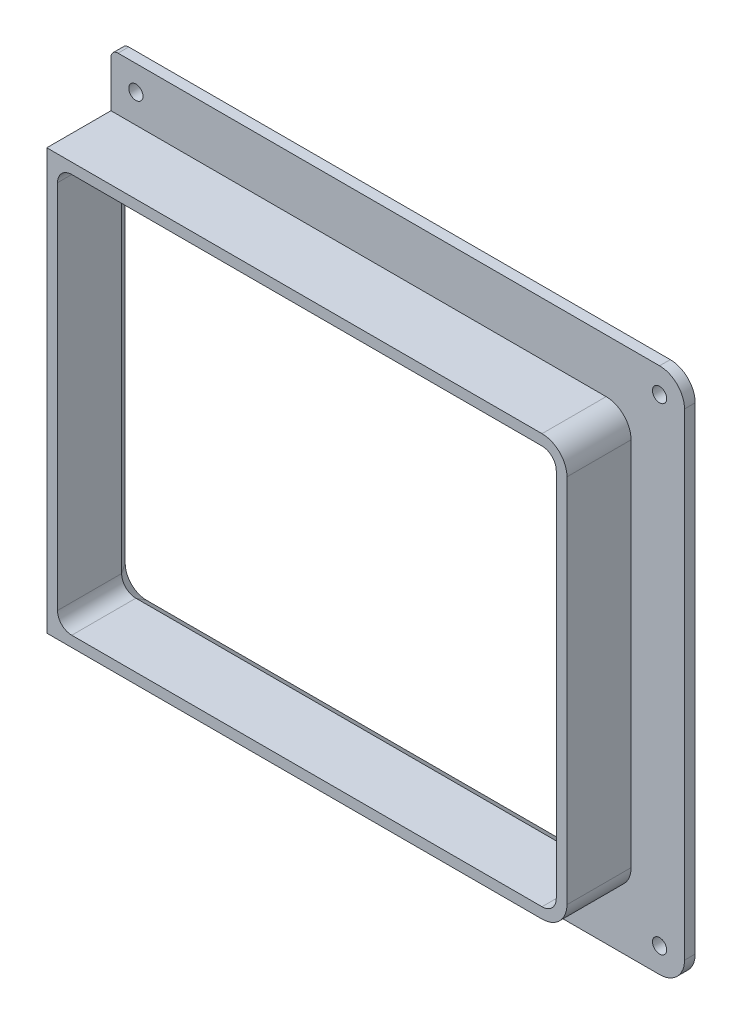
ISO-10303-21;
HEADER;
FILE_DESCRIPTION(('STEP AP214'),'2;1');
FILE_NAME('part.step','',(''),(''),'','','');
FILE_SCHEMA(('AUTOMOTIVE_DESIGN { 1 0 10303 214 1 1 1 1 }'));
ENDSEC;
DATA;
#1=APPLICATION_CONTEXT('core data for automotive mechanical design processes');
#2=APPLICATION_PROTOCOL_DEFINITION('international standard','automotive_design',2000,#1);
#3=PRODUCT_CONTEXT('',#1,'mechanical');
#4=PRODUCT('Part','Part','',(#3));
#5=PRODUCT_RELATED_PRODUCT_CATEGORY('part','',(#4));
#6=PRODUCT_DEFINITION_FORMATION('','',#4);
#7=PRODUCT_DEFINITION_CONTEXT('part definition',#1,'design');
#8=PRODUCT_DEFINITION('design','',#6,#7);
#9=PRODUCT_DEFINITION_SHAPE('','',#8);
#10=(LENGTH_UNIT() NAMED_UNIT(*) SI_UNIT(.MILLI.,.METRE.));
#11=(NAMED_UNIT(*) PLANE_ANGLE_UNIT() SI_UNIT($,.RADIAN.));
#12=(NAMED_UNIT(*) SI_UNIT($,.STERADIAN.) SOLID_ANGLE_UNIT());
#13=UNCERTAINTY_MEASURE_WITH_UNIT(LENGTH_MEASURE(1.E-05),#10,'distance_accuracy_value','');
#14=(GEOMETRIC_REPRESENTATION_CONTEXT(3) GLOBAL_UNCERTAINTY_ASSIGNED_CONTEXT((#13)) GLOBAL_UNIT_ASSIGNED_CONTEXT((#10,
#11,#12)) REPRESENTATION_CONTEXT('',''));
#15=CARTESIAN_POINT('',(0.,0.,0.));
#16=DIRECTION('',(0.,0.,1.));
#17=DIRECTION('',(1.,0.,0.));
#18=AXIS2_PLACEMENT_3D('',#15,#16,#17);
#19=CARTESIAN_POINT('',(146.,0.,0.));
#20=DIRECTION('',(1.,0.,0.));
#21=DIRECTION('',(0.,0.,-1.));
#22=AXIS2_PLACEMENT_3D('',#19,#20,#21);
#23=PLANE('',#22);
#24=DIRECTION('',(0.,-1.,0.));
#25=VECTOR('',#24,1.);
#26=CARTESIAN_POINT('',(146.,0.,21.));
#27=LINE('',#26,#25);
#28=CARTESIAN_POINT('',(146.,111.,21.));
#29=VERTEX_POINT('',#28);
#30=CARTESIAN_POINT('',(146.,7.,21.));
#31=VERTEX_POINT('',#30);
#32=EDGE_CURVE('E240',#29,#31,#27,.T.);
#33=ORIENTED_EDGE('',*,*,#32,.T.);
#34=DIRECTION('',(0.,0.,-1.));
#35=VECTOR('',#34,1.);
#36=CARTESIAN_POINT('',(146.,7.,3.));
#37=LINE('',#36,#35);
#38=CARTESIAN_POINT('',(146.,7.00000000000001,3.));
#39=VERTEX_POINT('',#38);
#40=EDGE_CURVE('E303',#31,#39,#37,.T.);
#41=ORIENTED_EDGE('',*,*,#40,.T.);
#42=DIRECTION('',(0.,-1.,0.));
#43=VECTOR('',#42,1.);
#44=CARTESIAN_POINT('',(146.,118.,3.));
#45=LINE('',#44,#43);
#46=CARTESIAN_POINT('',(146.,111.,3.));
#47=VERTEX_POINT('',#46);
#48=EDGE_CURVE('E375',#47,#39,#45,.T.);
#49=ORIENTED_EDGE('',*,*,#48,.F.);
#50=DIRECTION('',(0.,0.,-1.));
#51=VECTOR('',#50,1.);
#52=CARTESIAN_POINT('',(146.,111.,0.));
#53=LINE('',#52,#51);
#54=EDGE_CURVE('E301',#47,#29,#53,.F.);
#55=ORIENTED_EDGE('',*,*,#54,.T.);
#56=EDGE_LOOP('',(#33,#41,#49,#55));
#57=FACE_BOUND('',#56,.T.);
#58=ADVANCED_FACE('F41',(#57),#23,.T.);
#59=CARTESIAN_POINT('',(146.,118.,139.038129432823));
#60=DIRECTION('',(0.,1.,0.));
#61=DIRECTION('',(0.,0.,1.));
#62=AXIS2_PLACEMENT_3D('',#59,#60,#61);
#63=PLANE('',#62);
#64=DIRECTION('',(-1.,0.,0.));
#65=VECTOR('',#64,1.);
#66=CARTESIAN_POINT('',(146.,118.,21.));
#67=LINE('',#66,#65);
#68=CARTESIAN_POINT('',(139.,118.,21.));
#69=VERTEX_POINT('',#68);
#70=CARTESIAN_POINT('',(0.,118.,21.));
#71=VERTEX_POINT('',#70);
#72=EDGE_CURVE('E405',#69,#71,#67,.T.);
#73=ORIENTED_EDGE('',*,*,#72,.F.);
#74=DIRECTION('',(0.,0.,-1.));
#75=VECTOR('',#74,1.);
#76=CARTESIAN_POINT('',(139.,118.,139.038129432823));
#77=LINE('',#76,#75);
#78=CARTESIAN_POINT('',(139.,118.,3.));
#79=VERTEX_POINT('',#78);
#80=EDGE_CURVE('E312',#69,#79,#77,.T.);
#81=ORIENTED_EDGE('',*,*,#80,.T.);
#82=DIRECTION('',(-1.,0.,0.));
#83=VECTOR('',#82,1.);
#84=CARTESIAN_POINT('',(161.,118.,3.));
#85=LINE('',#84,#83);
#86=CARTESIAN_POINT('',(0.,118.,3.));
#87=VERTEX_POINT('',#86);
#88=EDGE_CURVE('E253',#79,#87,#85,.T.);
#89=ORIENTED_EDGE('',*,*,#88,.T.);
#90=DIRECTION('',(0.,0.,1.));
#91=VECTOR('',#90,1.);
#92=CARTESIAN_POINT('',(0.,118.,0.));
#93=LINE('',#92,#91);
#94=EDGE_CURVE('E414',#87,#71,#93,.T.);
#95=ORIENTED_EDGE('',*,*,#94,.T.);
#96=EDGE_LOOP('',(#73,#81,#89,#95));
#97=FACE_BOUND('',#96,.T.);
#98=ADVANCED_FACE('F470',(#97),#63,.T.);
#99=CARTESIAN_POINT('',(143.,118.,139.038129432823));
#100=DIRECTION('',(-1.,0.,0.));
#101=DIRECTION('',(0.,-1.,0.));
#102=AXIS2_PLACEMENT_3D('',#99,#100,#101);
#103=PLANE('',#102);
#104=DIRECTION('',(0.,0.,-1.));
#105=VECTOR('',#104,1.);
#106=CARTESIAN_POINT('',(143.,111.,139.038129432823));
#107=LINE('',#106,#105);
#108=CARTESIAN_POINT('',(143.,111.,21.));
#109=VERTEX_POINT('',#108);
#110=CARTESIAN_POINT('',(143.,111.,3.));
#111=VERTEX_POINT('',#110);
#112=EDGE_CURVE('E269',#109,#111,#107,.T.);
#113=ORIENTED_EDGE('',*,*,#112,.T.);
#114=DIRECTION('',(0.,-1.,0.));
#115=VECTOR('',#114,1.);
#116=CARTESIAN_POINT('',(143.,7.00000000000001,3.));
#117=LINE('',#116,#115);
#118=CARTESIAN_POINT('',(143.,7.00000000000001,3.));
#119=VERTEX_POINT('',#118);
#120=EDGE_CURVE('E350',#111,#119,#117,.T.);
#121=ORIENTED_EDGE('',*,*,#120,.T.);
#122=DIRECTION('',(0.,0.,-1.));
#123=VECTOR('',#122,1.);
#124=CARTESIAN_POINT('',(143.,7.00000000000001,139.038129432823));
#125=LINE('',#124,#123);
#126=CARTESIAN_POINT('',(143.,7.00000000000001,21.));
#127=VERTEX_POINT('',#126);
#128=EDGE_CURVE('E272',#119,#127,#125,.F.);
#129=ORIENTED_EDGE('',*,*,#128,.T.);
#130=DIRECTION('',(0.,-1.,0.));
#131=VECTOR('',#130,1.);
#132=CARTESIAN_POINT('',(143.,118.,21.));
#133=LINE('',#132,#131);
#134=EDGE_CURVE('E406',#109,#127,#133,.T.);
#135=ORIENTED_EDGE('',*,*,#134,.F.);
#136=EDGE_LOOP('',(#113,#121,#129,#135));
#137=FACE_BOUND('',#136,.T.);
#138=ADVANCED_FACE('F492',(#137),#103,.T.);
#139=CARTESIAN_POINT('',(146.,0.,0.));
#140=DIRECTION('',(0.,0.,1.));
#141=DIRECTION('',(1.,0.,0.));
#142=AXIS2_PLACEMENT_3D('',#139,#140,#141);
#143=PLANE('',#142);
#144=CARTESIAN_POINT('',(7.00000000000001,111.,0.));
#145=DIRECTION('',(0.,0.,1.));
#146=DIRECTION('',(1.,0.,0.));
#147=AXIS2_PLACEMENT_3D('',#144,#145,#146);
#148=CIRCLE('',#147,6.00000000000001);
#149=CARTESIAN_POINT('',(7.00000000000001,117.,0.));
#150=VERTEX_POINT('',#149);
#151=CARTESIAN_POINT('',(1.,111.,0.));
#152=VERTEX_POINT('',#151);
#153=EDGE_CURVE('E328',#150,#152,#148,.T.);
#154=ORIENTED_EDGE('',*,*,#153,.T.);
#155=DIRECTION('',(0.,-1.,0.));
#156=VECTOR('',#155,1.);
#157=CARTESIAN_POINT('',(0.999999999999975,7.00000000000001,0.));
#158=LINE('',#157,#156);
#159=CARTESIAN_POINT('',(0.999999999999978,7.00000000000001,0.));
#160=VERTEX_POINT('',#159);
#161=EDGE_CURVE('E332',#152,#160,#158,.T.);
#162=ORIENTED_EDGE('',*,*,#161,.T.);
#163=CARTESIAN_POINT('',(6.99999999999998,7.,0.));
#164=DIRECTION('',(0.,0.,1.));
#165=DIRECTION('',(1.,0.,0.));
#166=AXIS2_PLACEMENT_3D('',#163,#164,#165);
#167=CIRCLE('',#166,6.);
#168=CARTESIAN_POINT('',(6.99999999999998,1.,0.));
#169=VERTEX_POINT('',#168);
#170=EDGE_CURVE('E330',#160,#169,#167,.T.);
#171=ORIENTED_EDGE('',*,*,#170,.T.);
#172=DIRECTION('',(1.,0.,0.));
#173=VECTOR('',#172,1.);
#174=CARTESIAN_POINT('',(146.,1.,0.));
#175=LINE('',#174,#173);
#176=CARTESIAN_POINT('',(139.,0.999999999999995,0.));
#177=VERTEX_POINT('',#176);
#178=EDGE_CURVE('E326',#169,#177,#175,.T.);
#179=ORIENTED_EDGE('',*,*,#178,.T.);
#180=CARTESIAN_POINT('',(139.,7.,0.));
#181=DIRECTION('',(0.,0.,1.));
#182=DIRECTION('',(1.,0.,0.));
#183=AXIS2_PLACEMENT_3D('',#180,#181,#182);
#184=CIRCLE('',#183,6.00000000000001);
#185=CARTESIAN_POINT('',(145.,7.00000000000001,0.));
#186=VERTEX_POINT('',#185);
#187=EDGE_CURVE('E322',#177,#186,#184,.T.);
#188=ORIENTED_EDGE('',*,*,#187,.T.);
#189=DIRECTION('',(0.,1.,0.));
#190=VECTOR('',#189,1.);
#191=CARTESIAN_POINT('',(145.,111.,0.));
#192=LINE('',#191,#190);
#193=CARTESIAN_POINT('',(145.,111.,0.));
#194=VERTEX_POINT('',#193);
#195=EDGE_CURVE('E318',#186,#194,#192,.T.);
#196=ORIENTED_EDGE('',*,*,#195,.T.);
#197=CARTESIAN_POINT('',(139.,111.,0.));
#198=DIRECTION('',(0.,0.,1.));
#199=DIRECTION('',(1.,0.,0.));
#200=AXIS2_PLACEMENT_3D('',#197,#198,#199);
#201=CIRCLE('',#200,6.00000000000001);
#202=CARTESIAN_POINT('',(139.,117.,0.));
#203=VERTEX_POINT('',#202);
#204=EDGE_CURVE('E320',#194,#203,#201,.T.);
#205=ORIENTED_EDGE('',*,*,#204,.T.);
#206=DIRECTION('',(-1.,0.,0.));
#207=VECTOR('',#206,1.);
#208=CARTESIAN_POINT('',(146.,117.,0.));
#209=LINE('',#208,#207);
#210=EDGE_CURVE('E324',#203,#150,#209,.T.);
#211=ORIENTED_EDGE('',*,*,#210,.T.);
#212=EDGE_LOOP('',(#154,#162,#171,#179,#188,#196,#205,#211));
#213=FACE_BOUND('',#212,.T.);
#214=DIRECTION('',(-1.,0.,0.));
#215=VECTOR('',#214,1.);
#216=CARTESIAN_POINT('',(161.,-15.,0.));
#217=LINE('',#216,#215);
#218=CARTESIAN_POINT('',(154.,-15.,0.));
#219=VERTEX_POINT('',#218);
#220=CARTESIAN_POINT('',(2.,-15.,0.));
#221=VERTEX_POINT('',#220);
#222=EDGE_CURVE('E403',#219,#221,#217,.T.);
#223=ORIENTED_EDGE('',*,*,#222,.T.);
#224=CARTESIAN_POINT('',(2.,-13.,0.));
#225=DIRECTION('',(0.,0.,1.));
#226=DIRECTION('',(1.,0.,0.));
#227=AXIS2_PLACEMENT_3D('',#224,#225,#226);
#228=CIRCLE('',#227,2.);
#229=CARTESIAN_POINT('',(0.,-13.,0.));
#230=VERTEX_POINT('',#229);
#231=EDGE_CURVE('E380',#221,#230,#228,.F.);
#232=ORIENTED_EDGE('',*,*,#231,.T.);
#233=DIRECTION('',(0.,1.,0.));
#234=VECTOR('',#233,1.);
#235=CARTESIAN_POINT('',(0.,0.,0.));
#236=LINE('',#235,#234);
#237=CARTESIAN_POINT('',(0.,131.,0.));
#238=VERTEX_POINT('',#237);
#239=EDGE_CURVE('E245',#230,#238,#236,.T.);
#240=ORIENTED_EDGE('',*,*,#239,.T.);
#241=CARTESIAN_POINT('',(2.,131.,0.));
#242=DIRECTION('',(0.,0.,1.));
#243=DIRECTION('',(1.,0.,0.));
#244=AXIS2_PLACEMENT_3D('',#241,#242,#243);
#245=CIRCLE('',#244,2.);
#246=CARTESIAN_POINT('',(2.,133.,0.));
#247=VERTEX_POINT('',#246);
#248=EDGE_CURVE('E378',#238,#247,#245,.F.);
#249=ORIENTED_EDGE('',*,*,#248,.T.);
#250=DIRECTION('',(1.,0.,0.));
#251=VECTOR('',#250,1.);
#252=CARTESIAN_POINT('',(161.,133.,0.));
#253=LINE('',#252,#251);
#254=CARTESIAN_POINT('',(154.,133.,0.));
#255=VERTEX_POINT('',#254);
#256=EDGE_CURVE('E438',#247,#255,#253,.T.);
#257=ORIENTED_EDGE('',*,*,#256,.T.);
#258=CARTESIAN_POINT('',(154.,126.,0.));
#259=DIRECTION('',(0.,0.,1.));
#260=DIRECTION('',(1.,0.,0.));
#261=AXIS2_PLACEMENT_3D('',#258,#259,#260);
#262=CIRCLE('',#261,7.);
#263=CARTESIAN_POINT('',(161.,126.,0.));
#264=VERTEX_POINT('',#263);
#265=EDGE_CURVE('E287',#255,#264,#262,.F.);
#266=ORIENTED_EDGE('',*,*,#265,.T.);
#267=DIRECTION('',(0.,-1.,0.));
#268=VECTOR('',#267,1.);
#269=CARTESIAN_POINT('',(161.,0.,0.));
#270=LINE('',#269,#268);
#271=CARTESIAN_POINT('',(161.,-8.,0.));
#272=VERTEX_POINT('',#271);
#273=EDGE_CURVE('E420',#264,#272,#270,.T.);
#274=ORIENTED_EDGE('',*,*,#273,.T.);
#275=CARTESIAN_POINT('',(154.,-8.,0.));
#276=DIRECTION('',(0.,0.,1.));
#277=DIRECTION('',(1.,0.,0.));
#278=AXIS2_PLACEMENT_3D('',#275,#276,#277);
#279=CIRCLE('',#278,7.);
#280=EDGE_CURVE('E285',#272,#219,#279,.F.);
#281=ORIENTED_EDGE('',*,*,#280,.T.);
#282=EDGE_LOOP('',(#223,#232,#240,#249,#257,#266,#274,#281));
#283=FACE_BOUND('',#282,.T.);
#284=CARTESIAN_POINT('',(7.00000000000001,-8.,0.));
#285=DIRECTION('',(0.,0.,-1.));
#286=DIRECTION('',(1.,0.,0.));
#287=AXIS2_PLACEMENT_3D('',#284,#285,#286);
#288=CIRCLE('',#287,2.);
#289=CARTESIAN_POINT('',(9.00000000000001,-8.,0.));
#290=VERTEX_POINT('',#289);
#291=EDGE_CURVE('E432',#290,#290,#288,.T.);
#292=ORIENTED_EDGE('',*,*,#291,.F.);
#293=EDGE_LOOP('',(#292));
#294=FACE_BOUND('',#293,.T.);
#295=CARTESIAN_POINT('',(154.,-8.,0.));
#296=DIRECTION('',(0.,0.,-1.));
#297=DIRECTION('',(-1.,0.,0.));
#298=AXIS2_PLACEMENT_3D('',#295,#296,#297);
#299=CIRCLE('',#298,2.);
#300=CARTESIAN_POINT('',(152.,-8.,0.));
#301=VERTEX_POINT('',#300);
#302=EDGE_CURVE('E426',#301,#301,#299,.T.);
#303=ORIENTED_EDGE('',*,*,#302,.F.);
#304=EDGE_LOOP('',(#303));
#305=FACE_BOUND('',#304,.T.);
#306=CARTESIAN_POINT('',(154.,126.,0.));
#307=DIRECTION('',(0.,0.,-1.));
#308=DIRECTION('',(1.,0.,0.));
#309=AXIS2_PLACEMENT_3D('',#306,#307,#308);
#310=CIRCLE('',#309,2.);
#311=CARTESIAN_POINT('',(156.,126.,0.));
#312=VERTEX_POINT('',#311);
#313=EDGE_CURVE('E451',#312,#312,#310,.T.);
#314=ORIENTED_EDGE('',*,*,#313,.F.);
#315=EDGE_LOOP('',(#314));
#316=FACE_BOUND('',#315,.T.);
#317=CARTESIAN_POINT('',(7.00000000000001,126.,0.));
#318=DIRECTION('',(0.,0.,-1.));
#319=DIRECTION('',(-1.,0.,0.));
#320=AXIS2_PLACEMENT_3D('',#317,#318,#319);
#321=CIRCLE('',#320,2.);
#322=CARTESIAN_POINT('',(5.00000000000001,126.,0.));
#323=VERTEX_POINT('',#322);
#324=EDGE_CURVE('E445',#323,#323,#321,.T.);
#325=ORIENTED_EDGE('',*,*,#324,.F.);
#326=EDGE_LOOP('',(#325));
#327=FACE_BOUND('',#326,.T.);
#328=ADVANCED_FACE('F401',(#213,#283,#294,#305,#316,#327),#143,.F.);
#329=CARTESIAN_POINT('',(146.,3.,0.));
#330=DIRECTION('',(0.,-1.,0.));
#331=DIRECTION('',(0.,0.,-1.));
#332=AXIS2_PLACEMENT_3D('',#329,#330,#331);
#333=PLANE('',#332);
#334=DIRECTION('',(0.,0.,-1.));
#335=VECTOR('',#334,1.);
#336=CARTESIAN_POINT('',(139.,3.,0.));
#337=LINE('',#336,#335);
#338=CARTESIAN_POINT('',(139.,3.,21.));
#339=VERTEX_POINT('',#338);
#340=CARTESIAN_POINT('',(139.,3.,3.));
#341=VERTEX_POINT('',#340);
#342=EDGE_CURVE('E264',#339,#341,#337,.T.);
#343=ORIENTED_EDGE('',*,*,#342,.T.);
#344=DIRECTION('',(-1.,0.,0.));
#345=VECTOR('',#344,1.);
#346=CARTESIAN_POINT('',(146.,3.,3.));
#347=LINE('',#346,#345);
#348=CARTESIAN_POINT('',(6.99999999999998,3.,3.));
#349=VERTEX_POINT('',#348);
#350=EDGE_CURVE('E342',#341,#349,#347,.T.);
#351=ORIENTED_EDGE('',*,*,#350,.T.);
#352=DIRECTION('',(0.,0.,1.));
#353=VECTOR('',#352,1.);
#354=CARTESIAN_POINT('',(6.99999999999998,3.,0.));
#355=LINE('',#354,#353);
#356=CARTESIAN_POINT('',(6.99999999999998,3.,21.));
#357=VERTEX_POINT('',#356);
#358=EDGE_CURVE('E267',#349,#357,#355,.T.);
#359=ORIENTED_EDGE('',*,*,#358,.T.);
#360=DIRECTION('',(-1.,0.,0.));
#361=VECTOR('',#360,1.);
#362=CARTESIAN_POINT('',(146.,3.,21.));
#363=LINE('',#362,#361);
#364=EDGE_CURVE('E250',#339,#357,#363,.T.);
#365=ORIENTED_EDGE('',*,*,#364,.F.);
#366=EDGE_LOOP('',(#343,#351,#359,#365));
#367=FACE_BOUND('',#366,.T.);
#368=ADVANCED_FACE('F503',(#367),#333,.F.);
#369=CARTESIAN_POINT('',(146.,0.,21.));
#370=DIRECTION('',(0.,0.,-1.));
#371=DIRECTION('',(-1.,0.,0.));
#372=AXIS2_PLACEMENT_3D('',#369,#370,#371);
#373=PLANE('',#372);
#374=ORIENTED_EDGE('',*,*,#134,.T.);
#375=CARTESIAN_POINT('',(139.,7.,21.));
#376=DIRECTION('',(0.,0.,-1.));
#377=DIRECTION('',(-1.,0.,0.));
#378=AXIS2_PLACEMENT_3D('',#375,#376,#377);
#379=CIRCLE('',#378,4.);
#380=EDGE_CURVE('E278',#127,#339,#379,.T.);
#381=ORIENTED_EDGE('',*,*,#380,.T.);
#382=ORIENTED_EDGE('',*,*,#364,.T.);
#383=CARTESIAN_POINT('',(6.99999999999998,7.,21.));
#384=DIRECTION('',(0.,0.,-1.));
#385=DIRECTION('',(-1.,0.,0.));
#386=AXIS2_PLACEMENT_3D('',#383,#384,#385);
#387=CIRCLE('',#386,4.);
#388=CARTESIAN_POINT('',(2.99999999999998,7.00000000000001,21.));
#389=VERTEX_POINT('',#388);
#390=EDGE_CURVE('E276',#357,#389,#387,.T.);
#391=ORIENTED_EDGE('',*,*,#390,.T.);
#392=DIRECTION('',(0.,1.,0.));
#393=VECTOR('',#392,1.);
#394=CARTESIAN_POINT('',(3.,118.,21.));
#395=LINE('',#394,#393);
#396=CARTESIAN_POINT('',(3.,111.,21.));
#397=VERTEX_POINT('',#396);
#398=EDGE_CURVE('E234',#389,#397,#395,.T.);
#399=ORIENTED_EDGE('',*,*,#398,.T.);
#400=CARTESIAN_POINT('',(7.00000000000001,111.,21.));
#401=DIRECTION('',(0.,0.,-1.));
#402=DIRECTION('',(-1.,0.,0.));
#403=AXIS2_PLACEMENT_3D('',#400,#401,#402);
#404=CIRCLE('',#403,4.);
#405=CARTESIAN_POINT('',(7.00000000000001,115.,21.));
#406=VERTEX_POINT('',#405);
#407=EDGE_CURVE('E274',#397,#406,#404,.T.);
#408=ORIENTED_EDGE('',*,*,#407,.T.);
#409=DIRECTION('',(-1.,0.,0.));
#410=VECTOR('',#409,1.);
#411=CARTESIAN_POINT('',(146.,115.,21.));
#412=LINE('',#411,#410);
#413=CARTESIAN_POINT('',(139.,115.,21.));
#414=VERTEX_POINT('',#413);
#415=EDGE_CURVE('E411',#414,#406,#412,.T.);
#416=ORIENTED_EDGE('',*,*,#415,.F.);
#417=CARTESIAN_POINT('',(139.,111.,21.));
#418=DIRECTION('',(0.,0.,-1.));
#419=DIRECTION('',(-1.,0.,0.));
#420=AXIS2_PLACEMENT_3D('',#417,#418,#419);
#421=CIRCLE('',#420,4.);
#422=EDGE_CURVE('E280',#414,#109,#421,.T.);
#423=ORIENTED_EDGE('',*,*,#422,.T.);
#424=EDGE_LOOP('',(#374,#381,#382,#391,#399,#408,#416,#423));
#425=FACE_BOUND('',#424,.T.);
#426=DIRECTION('',(-1.,0.,0.));
#427=VECTOR('',#426,1.);
#428=CARTESIAN_POINT('',(146.,0.,21.));
#429=LINE('',#428,#427);
#430=CARTESIAN_POINT('',(139.,0.,21.));
#431=VERTEX_POINT('',#430);
#432=CARTESIAN_POINT('',(0.,0.,21.));
#433=VERTEX_POINT('',#432);
#434=EDGE_CURVE('E238',#431,#433,#429,.T.);
#435=ORIENTED_EDGE('',*,*,#434,.F.);
#436=CARTESIAN_POINT('',(139.,7.,21.));
#437=DIRECTION('',(0.,0.,-1.));
#438=DIRECTION('',(-1.,0.,0.));
#439=AXIS2_PLACEMENT_3D('',#436,#437,#438);
#440=CIRCLE('',#439,7.);
#441=EDGE_CURVE('E310',#431,#31,#440,.F.);
#442=ORIENTED_EDGE('',*,*,#441,.T.);
#443=ORIENTED_EDGE('',*,*,#32,.F.);
#444=CARTESIAN_POINT('',(139.,111.,21.));
#445=DIRECTION('',(0.,0.,-1.));
#446=DIRECTION('',(-1.,0.,0.));
#447=AXIS2_PLACEMENT_3D('',#444,#445,#446);
#448=CIRCLE('',#447,7.);
#449=EDGE_CURVE('E308',#29,#69,#448,.F.);
#450=ORIENTED_EDGE('',*,*,#449,.T.);
#451=ORIENTED_EDGE('',*,*,#72,.T.);
#452=DIRECTION('',(0.,-1.,0.));
#453=VECTOR('',#452,1.);
#454=CARTESIAN_POINT('',(0.,0.,21.));
#455=LINE('',#454,#453);
#456=EDGE_CURVE('E241',#71,#433,#455,.T.);
#457=ORIENTED_EDGE('',*,*,#456,.T.);
#458=EDGE_LOOP('',(#435,#442,#443,#450,#451,#457));
#459=FACE_BOUND('',#458,.T.);
#460=ADVANCED_FACE('F468',(#425,#459),#373,.F.);
#461=CARTESIAN_POINT('',(146.,0.,0.));
#462=DIRECTION('',(0.,1.,0.));
#463=DIRECTION('',(0.,0.,1.));
#464=AXIS2_PLACEMENT_3D('',#461,#462,#463);
#465=PLANE('',#464);
#466=DIRECTION('',(1.,0.,0.));
#467=VECTOR('',#466,1.);
#468=CARTESIAN_POINT('',(161.,0.,3.));
#469=LINE('',#468,#467);
#470=CARTESIAN_POINT('',(0.,0.,3.));
#471=VERTEX_POINT('',#470);
#472=CARTESIAN_POINT('',(139.,0.,3.));
#473=VERTEX_POINT('',#472);
#474=EDGE_CURVE('E224',#471,#473,#469,.T.);
#475=ORIENTED_EDGE('',*,*,#474,.T.);
#476=DIRECTION('',(0.,0.,-1.));
#477=VECTOR('',#476,1.);
#478=CARTESIAN_POINT('',(139.,0.,21.));
#479=LINE('',#478,#477);
#480=EDGE_CURVE('E306',#473,#431,#479,.F.);
#481=ORIENTED_EDGE('',*,*,#480,.T.);
#482=ORIENTED_EDGE('',*,*,#434,.T.);
#483=DIRECTION('',(0.,0.,-1.));
#484=VECTOR('',#483,1.);
#485=CARTESIAN_POINT('',(0.,0.,0.));
#486=LINE('',#485,#484);
#487=EDGE_CURVE('E220',#433,#471,#486,.T.);
#488=ORIENTED_EDGE('',*,*,#487,.T.);
#489=EDGE_LOOP('',(#475,#481,#482,#488));
#490=FACE_BOUND('',#489,.T.);
#491=ADVANCED_FACE('F236',(#490),#465,.F.);
#492=CARTESIAN_POINT('',(0.,0.,0.));
#493=DIRECTION('',(1.,0.,0.));
#494=DIRECTION('',(0.,0.,-1.));
#495=AXIS2_PLACEMENT_3D('',#492,#493,#494);
#496=PLANE('',#495);
#497=ORIENTED_EDGE('',*,*,#239,.F.);
#498=DIRECTION('',(0.,0.,-1.));
#499=VECTOR('',#498,1.);
#500=CARTESIAN_POINT('',(0.,-13.,3.));
#501=LINE('',#500,#499);
#502=CARTESIAN_POINT('',(0.,-13.,3.));
#503=VERTEX_POINT('',#502);
#504=EDGE_CURVE('E222',#230,#503,#501,.F.);
#505=ORIENTED_EDGE('',*,*,#504,.T.);
#506=DIRECTION('',(0.,1.,0.));
#507=VECTOR('',#506,1.);
#508=CARTESIAN_POINT('',(0.,0.,3.));
#509=LINE('',#508,#507);
#510=EDGE_CURVE('E214',#503,#471,#509,.T.);
#511=ORIENTED_EDGE('',*,*,#510,.T.);
#512=ORIENTED_EDGE('',*,*,#487,.F.);
#513=ORIENTED_EDGE('',*,*,#456,.F.);
#514=ORIENTED_EDGE('',*,*,#94,.F.);
#515=DIRECTION('',(0.,1.,0.));
#516=VECTOR('',#515,1.);
#517=CARTESIAN_POINT('',(0.,118.,3.));
#518=LINE('',#517,#516);
#519=CARTESIAN_POINT('',(0.,131.,3.));
#520=VERTEX_POINT('',#519);
#521=EDGE_CURVE('E440',#87,#520,#518,.T.);
#522=ORIENTED_EDGE('',*,*,#521,.T.);
#523=DIRECTION('',(0.,0.,-1.));
#524=VECTOR('',#523,1.);
#525=CARTESIAN_POINT('',(0.,131.,0.));
#526=LINE('',#525,#524);
#527=EDGE_CURVE('E382',#520,#238,#526,.T.);
#528=ORIENTED_EDGE('',*,*,#527,.T.);
#529=EDGE_LOOP('',(#497,#505,#511,#512,#513,#514,#522,#528));
#530=FACE_BOUND('',#529,.T.);
#531=ADVANCED_FACE('F217',(#530),#496,.F.);
#532=CARTESIAN_POINT('',(146.,115.,0.));
#533=DIRECTION('',(0.,1.,0.));
#534=DIRECTION('',(0.,0.,1.));
#535=AXIS2_PLACEMENT_3D('',#532,#533,#534);
#536=PLANE('',#535);
#537=DIRECTION('',(0.,0.,-1.));
#538=VECTOR('',#537,1.);
#539=CARTESIAN_POINT('',(7.00000000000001,115.,0.));
#540=LINE('',#539,#538);
#541=CARTESIAN_POINT('',(7.00000000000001,115.,3.));
#542=VERTEX_POINT('',#541);
#543=EDGE_CURVE('E256',#406,#542,#540,.T.);
#544=ORIENTED_EDGE('',*,*,#543,.T.);
#545=DIRECTION('',(1.,0.,0.));
#546=VECTOR('',#545,1.);
#547=CARTESIAN_POINT('',(146.,115.,3.));
#548=LINE('',#547,#546);
#549=CARTESIAN_POINT('',(139.,115.,3.));
#550=VERTEX_POINT('',#549);
#551=EDGE_CURVE('E344',#542,#550,#548,.T.);
#552=ORIENTED_EDGE('',*,*,#551,.T.);
#553=DIRECTION('',(0.,0.,-1.));
#554=VECTOR('',#553,1.);
#555=CARTESIAN_POINT('',(139.,115.,0.));
#556=LINE('',#555,#554);
#557=EDGE_CURVE('E254',#550,#414,#556,.F.);
#558=ORIENTED_EDGE('',*,*,#557,.T.);
#559=ORIENTED_EDGE('',*,*,#415,.T.);
#560=EDGE_LOOP('',(#544,#552,#558,#559));
#561=FACE_BOUND('',#560,.T.);
#562=ADVANCED_FACE('F498',(#561),#536,.F.);
#563=CARTESIAN_POINT('',(3.,118.,139.038129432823));
#564=DIRECTION('',(1.,0.,0.));
#565=DIRECTION('',(0.,1.,0.));
#566=AXIS2_PLACEMENT_3D('',#563,#564,#565);
#567=PLANE('',#566);
#568=DIRECTION('',(0.,0.,1.));
#569=VECTOR('',#568,1.);
#570=CARTESIAN_POINT('',(2.99999999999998,7.00000000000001,139.038129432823));
#571=LINE('',#570,#569);
#572=CARTESIAN_POINT('',(2.99999999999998,7.00000000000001,3.));
#573=VERTEX_POINT('',#572);
#574=EDGE_CURVE('E259',#389,#573,#571,.F.);
#575=ORIENTED_EDGE('',*,*,#574,.T.);
#576=DIRECTION('',(0.,1.,0.));
#577=VECTOR('',#576,1.);
#578=CARTESIAN_POINT('',(3.,111.,3.));
#579=LINE('',#578,#577);
#580=CARTESIAN_POINT('',(3.,111.,3.));
#581=VERTEX_POINT('',#580);
#582=EDGE_CURVE('E335',#573,#581,#579,.T.);
#583=ORIENTED_EDGE('',*,*,#582,.T.);
#584=DIRECTION('',(0.,0.,-1.));
#585=VECTOR('',#584,1.);
#586=CARTESIAN_POINT('',(3.,111.,139.038129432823));
#587=LINE('',#586,#585);
#588=EDGE_CURVE('E262',#581,#397,#587,.F.);
#589=ORIENTED_EDGE('',*,*,#588,.T.);
#590=ORIENTED_EDGE('',*,*,#398,.F.);
#591=EDGE_LOOP('',(#575,#583,#589,#590));
#592=FACE_BOUND('',#591,.T.);
#593=ADVANCED_FACE('F608',(#592),#567,.T.);
#594=CARTESIAN_POINT('',(161.,0.,3.));
#595=DIRECTION('',(1.,0.,0.));
#596=DIRECTION('',(0.,0.,-1.));
#597=AXIS2_PLACEMENT_3D('',#594,#595,#596);
#598=PLANE('',#597);
#599=ORIENTED_EDGE('',*,*,#273,.F.);
#600=DIRECTION('',(0.,0.,-1.));
#601=VECTOR('',#600,1.);
#602=CARTESIAN_POINT('',(161.,126.,3.));
#603=LINE('',#602,#601);
#604=CARTESIAN_POINT('',(161.,126.,3.));
#605=VERTEX_POINT('',#604);
#606=EDGE_CURVE('E292',#264,#605,#603,.F.);
#607=ORIENTED_EDGE('',*,*,#606,.T.);
#608=DIRECTION('',(0.,-1.,0.));
#609=VECTOR('',#608,1.);
#610=CARTESIAN_POINT('',(161.,0.,3.));
#611=LINE('',#610,#609);
#612=CARTESIAN_POINT('',(161.,-8.,3.));
#613=VERTEX_POINT('',#612);
#614=EDGE_CURVE('E396',#605,#613,#611,.T.);
#615=ORIENTED_EDGE('',*,*,#614,.T.);
#616=DIRECTION('',(0.,0.,-1.));
#617=VECTOR('',#616,1.);
#618=CARTESIAN_POINT('',(161.,-8.,3.));
#619=LINE('',#618,#617);
#620=EDGE_CURVE('E289',#613,#272,#619,.T.);
#621=ORIENTED_EDGE('',*,*,#620,.T.);
#622=EDGE_LOOP('',(#599,#607,#615,#621));
#623=FACE_BOUND('',#622,.T.);
#624=ADVANCED_FACE('F540',(#623),#598,.T.);
#625=CARTESIAN_POINT('',(161.,-15.,3.));
#626=DIRECTION('',(0.,-1.,0.));
#627=DIRECTION('',(0.,0.,-1.));
#628=AXIS2_PLACEMENT_3D('',#625,#626,#627);
#629=PLANE('',#628);
#630=DIRECTION('',(-1.,0.,0.));
#631=VECTOR('',#630,1.);
#632=CARTESIAN_POINT('',(161.,-15.,3.));
#633=LINE('',#632,#631);
#634=CARTESIAN_POINT('',(154.,-15.,3.));
#635=VERTEX_POINT('',#634);
#636=CARTESIAN_POINT('',(2.,-15.,3.));
#637=VERTEX_POINT('',#636);
#638=EDGE_CURVE('E225',#635,#637,#633,.T.);
#639=ORIENTED_EDGE('',*,*,#638,.T.);
#640=DIRECTION('',(0.,0.,-1.));
#641=VECTOR('',#640,1.);
#642=CARTESIAN_POINT('',(2.,-15.,0.));
#643=LINE('',#642,#641);
#644=EDGE_CURVE('E352',#637,#221,#643,.T.);
#645=ORIENTED_EDGE('',*,*,#644,.T.);
#646=ORIENTED_EDGE('',*,*,#222,.F.);
#647=DIRECTION('',(0.,0.,-1.));
#648=VECTOR('',#647,1.);
#649=CARTESIAN_POINT('',(154.,-15.,3.));
#650=LINE('',#649,#648);
#651=EDGE_CURVE('E299',#219,#635,#650,.F.);
#652=ORIENTED_EDGE('',*,*,#651,.T.);
#653=EDGE_LOOP('',(#639,#645,#646,#652));
#654=FACE_BOUND('',#653,.T.);
#655=ADVANCED_FACE('F392',(#654),#629,.T.);
#656=CARTESIAN_POINT('',(0.,0.,3.));
#657=DIRECTION('',(0.,0.,-1.));
#658=DIRECTION('',(-1.,0.,0.));
#659=AXIS2_PLACEMENT_3D('',#656,#657,#658);
#660=PLANE('',#659);
#661=CARTESIAN_POINT('',(7.00000000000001,-8.,3.));
#662=DIRECTION('',(0.,0.,-1.));
#663=DIRECTION('',(1.,0.,0.));
#664=AXIS2_PLACEMENT_3D('',#661,#662,#663);
#665=CIRCLE('',#664,2.);
#666=CARTESIAN_POINT('',(9.00000000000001,-8.,3.));
#667=VERTEX_POINT('',#666);
#668=EDGE_CURVE('E429',#667,#667,#665,.T.);
#669=ORIENTED_EDGE('',*,*,#668,.T.);
#670=EDGE_LOOP('',(#669));
#671=FACE_BOUND('',#670,.T.);
#672=CARTESIAN_POINT('',(154.,-8.,3.));
#673=DIRECTION('',(0.,0.,-1.));
#674=DIRECTION('',(-1.,0.,0.));
#675=AXIS2_PLACEMENT_3D('',#672,#673,#674);
#676=CIRCLE('',#675,2.);
#677=CARTESIAN_POINT('',(152.,-8.,3.));
#678=VERTEX_POINT('',#677);
#679=EDGE_CURVE('E422',#678,#678,#676,.T.);
#680=ORIENTED_EDGE('',*,*,#679,.T.);
#681=EDGE_LOOP('',(#680));
#682=FACE_BOUND('',#681,.T.);
#683=ORIENTED_EDGE('',*,*,#510,.F.);
#684=CARTESIAN_POINT('',(2.,-13.,3.));
#685=DIRECTION('',(0.,0.,-1.));
#686=DIRECTION('',(-1.,0.,0.));
#687=AXIS2_PLACEMENT_3D('',#684,#685,#686);
#688=CIRCLE('',#687,2.);
#689=EDGE_CURVE('E49',#503,#637,#688,.F.);
#690=ORIENTED_EDGE('',*,*,#689,.T.);
#691=ORIENTED_EDGE('',*,*,#638,.F.);
#692=CARTESIAN_POINT('',(154.,-8.,3.));
#693=DIRECTION('',(0.,0.,-1.));
#694=DIRECTION('',(-1.,0.,0.));
#695=AXIS2_PLACEMENT_3D('',#692,#693,#694);
#696=CIRCLE('',#695,7.);
#697=EDGE_CURVE('E294',#635,#613,#696,.F.);
#698=ORIENTED_EDGE('',*,*,#697,.T.);
#699=ORIENTED_EDGE('',*,*,#614,.F.);
#700=CARTESIAN_POINT('',(154.,126.,3.));
#701=DIRECTION('',(0.,0.,-1.));
#702=DIRECTION('',(-1.,0.,0.));
#703=AXIS2_PLACEMENT_3D('',#700,#701,#702);
#704=CIRCLE('',#703,7.);
#705=CARTESIAN_POINT('',(154.,133.,3.));
#706=VERTEX_POINT('',#705);
#707=EDGE_CURVE('E296',#605,#706,#704,.F.);
#708=ORIENTED_EDGE('',*,*,#707,.T.);
#709=DIRECTION('',(1.,0.,0.));
#710=VECTOR('',#709,1.);
#711=CARTESIAN_POINT('',(161.,133.,3.));
#712=LINE('',#711,#710);
#713=CARTESIAN_POINT('',(2.,133.,3.));
#714=VERTEX_POINT('',#713);
#715=EDGE_CURVE('E435',#714,#706,#712,.T.);
#716=ORIENTED_EDGE('',*,*,#715,.F.);
#717=CARTESIAN_POINT('',(2.,131.,3.));
#718=DIRECTION('',(0.,0.,-1.));
#719=DIRECTION('',(-1.,0.,0.));
#720=AXIS2_PLACEMENT_3D('',#717,#718,#719);
#721=CIRCLE('',#720,2.);
#722=EDGE_CURVE('E61',#714,#520,#721,.F.);
#723=ORIENTED_EDGE('',*,*,#722,.T.);
#724=ORIENTED_EDGE('',*,*,#521,.F.);
#725=ORIENTED_EDGE('',*,*,#88,.F.);
#726=CARTESIAN_POINT('',(139.,111.,3.));
#727=DIRECTION('',(0.,0.,-1.));
#728=DIRECTION('',(-1.,0.,0.));
#729=AXIS2_PLACEMENT_3D('',#726,#727,#728);
#730=CIRCLE('',#729,7.);
#731=EDGE_CURVE('E316',#79,#47,#730,.T.);
#732=ORIENTED_EDGE('',*,*,#731,.T.);
#733=ORIENTED_EDGE('',*,*,#48,.T.);
#734=CARTESIAN_POINT('',(139.,7.,3.));
#735=DIRECTION('',(0.,0.,-1.));
#736=DIRECTION('',(-1.,0.,0.));
#737=AXIS2_PLACEMENT_3D('',#734,#735,#736);
#738=CIRCLE('',#737,7.);
#739=EDGE_CURVE('E231',#39,#473,#738,.T.);
#740=ORIENTED_EDGE('',*,*,#739,.T.);
#741=ORIENTED_EDGE('',*,*,#474,.F.);
#742=EDGE_LOOP('',(#683,#690,#691,#698,#699,#708,#716,#723,#724,#725,#732,#733,#740,#741));
#743=FACE_BOUND('',#742,.T.);
#744=CARTESIAN_POINT('',(154.,126.,3.));
#745=DIRECTION('',(0.,0.,-1.));
#746=DIRECTION('',(1.,0.,0.));
#747=AXIS2_PLACEMENT_3D('',#744,#745,#746);
#748=CIRCLE('',#747,2.);
#749=CARTESIAN_POINT('',(156.,126.,3.));
#750=VERTEX_POINT('',#749);
#751=EDGE_CURVE('E448',#750,#750,#748,.T.);
#752=ORIENTED_EDGE('',*,*,#751,.T.);
#753=EDGE_LOOP('',(#752));
#754=FACE_BOUND('',#753,.T.);
#755=CARTESIAN_POINT('',(7.00000000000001,126.,3.));
#756=DIRECTION('',(0.,0.,-1.));
#757=DIRECTION('',(-1.,0.,0.));
#758=AXIS2_PLACEMENT_3D('',#755,#756,#757);
#759=CIRCLE('',#758,2.);
#760=CARTESIAN_POINT('',(5.00000000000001,126.,3.));
#761=VERTEX_POINT('',#760);
#762=EDGE_CURVE('E441',#761,#761,#759,.T.);
#763=ORIENTED_EDGE('',*,*,#762,.T.);
#764=EDGE_LOOP('',(#763));
#765=FACE_BOUND('',#764,.T.);
#766=ADVANCED_FACE('F228',(#671,#682,#743,#754,#765),#660,.F.);
#767=CARTESIAN_POINT('',(154.,-8.,3.));
#768=DIRECTION('',(0.,0.,-1.));
#769=DIRECTION('',(-1.,0.,0.));
#770=AXIS2_PLACEMENT_3D('',#767,#768,#769);
#771=CYLINDRICAL_SURFACE('',#770,2.);
#772=ORIENTED_EDGE('',*,*,#679,.F.);
#773=EDGE_LOOP('',(#772));
#774=FACE_BOUND('',#773,.T.);
#775=ORIENTED_EDGE('',*,*,#302,.T.);
#776=EDGE_LOOP('',(#775));
#777=FACE_BOUND('',#776,.T.);
#778=ADVANCED_FACE('F685',(#774,#777),#771,.F.);
#779=CARTESIAN_POINT('',(7.00000000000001,-8.,3.));
#780=DIRECTION('',(0.,0.,-1.));
#781=DIRECTION('',(-1.,0.,0.));
#782=AXIS2_PLACEMENT_3D('',#779,#780,#781);
#783=CYLINDRICAL_SURFACE('',#782,2.);
#784=ORIENTED_EDGE('',*,*,#668,.F.);
#785=EDGE_LOOP('',(#784));
#786=FACE_BOUND('',#785,.T.);
#787=ORIENTED_EDGE('',*,*,#291,.T.);
#788=EDGE_LOOP('',(#787));
#789=FACE_BOUND('',#788,.T.);
#790=ADVANCED_FACE('F694',(#786,#789),#783,.F.);
#791=CARTESIAN_POINT('',(161.,133.,3.));
#792=DIRECTION('',(0.,1.,0.));
#793=DIRECTION('',(0.,0.,1.));
#794=AXIS2_PLACEMENT_3D('',#791,#792,#793);
#795=PLANE('',#794);
#796=ORIENTED_EDGE('',*,*,#256,.F.);
#797=DIRECTION('',(0.,0.,-1.));
#798=VECTOR('',#797,1.);
#799=CARTESIAN_POINT('',(2.,133.,3.));
#800=LINE('',#799,#798);
#801=EDGE_CURVE('E13',#247,#714,#800,.F.);
#802=ORIENTED_EDGE('',*,*,#801,.T.);
#803=ORIENTED_EDGE('',*,*,#715,.T.);
#804=DIRECTION('',(0.,0.,-1.));
#805=VECTOR('',#804,1.);
#806=CARTESIAN_POINT('',(154.,133.,3.));
#807=LINE('',#806,#805);
#808=EDGE_CURVE('E282',#706,#255,#807,.T.);
#809=ORIENTED_EDGE('',*,*,#808,.T.);
#810=EDGE_LOOP('',(#796,#802,#803,#809));
#811=FACE_BOUND('',#810,.T.);
#812=ADVANCED_FACE('F541',(#811),#795,.T.);
#813=CARTESIAN_POINT('',(7.00000000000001,126.,3.));
#814=DIRECTION('',(0.,0.,-1.));
#815=DIRECTION('',(-1.,0.,0.));
#816=AXIS2_PLACEMENT_3D('',#813,#814,#815);
#817=CYLINDRICAL_SURFACE('',#816,2.);
#818=ORIENTED_EDGE('',*,*,#762,.F.);
#819=EDGE_LOOP('',(#818));
#820=FACE_BOUND('',#819,.T.);
#821=ORIENTED_EDGE('',*,*,#324,.T.);
#822=EDGE_LOOP('',(#821));
#823=FACE_BOUND('',#822,.T.);
#824=ADVANCED_FACE('F709',(#820,#823),#817,.F.);
#825=CARTESIAN_POINT('',(154.,126.,3.));
#826=DIRECTION('',(0.,0.,-1.));
#827=DIRECTION('',(-1.,0.,0.));
#828=AXIS2_PLACEMENT_3D('',#825,#826,#827);
#829=CYLINDRICAL_SURFACE('',#828,2.);
#830=ORIENTED_EDGE('',*,*,#751,.F.);
#831=EDGE_LOOP('',(#830));
#832=FACE_BOUND('',#831,.T.);
#833=ORIENTED_EDGE('',*,*,#313,.T.);
#834=EDGE_LOOP('',(#833));
#835=FACE_BOUND('',#834,.T.);
#836=ADVANCED_FACE('F515',(#832,#835),#829,.F.);
#837=CARTESIAN_POINT('',(7.00000000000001,111.,0.));
#838=DIRECTION('',(0.,0.,-1.));
#839=DIRECTION('',(-1.,0.,0.));
#840=AXIS2_PLACEMENT_3D('',#837,#838,#839);
#841=CYLINDRICAL_SURFACE('',#840,4.);
#842=ORIENTED_EDGE('',*,*,#588,.F.);
#843=CARTESIAN_POINT('',(7.00000000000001,111.,3.));
#844=DIRECTION('',(0.,0.,1.));
#845=DIRECTION('',(1.,0.,0.));
#846=AXIS2_PLACEMENT_3D('',#843,#844,#845);
#847=CIRCLE('',#846,4.);
#848=EDGE_CURVE('E340',#581,#542,#847,.F.);
#849=ORIENTED_EDGE('',*,*,#848,.T.);
#850=ORIENTED_EDGE('',*,*,#543,.F.);
#851=ORIENTED_EDGE('',*,*,#407,.F.);
#852=EDGE_LOOP('',(#842,#849,#850,#851));
#853=FACE_BOUND('',#852,.T.);
#854=ADVANCED_FACE('F511',(#853),#841,.F.);
#855=CARTESIAN_POINT('',(6.99999999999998,7.,0.));
#856=DIRECTION('',(0.,0.,1.));
#857=DIRECTION('',(1.,0.,0.));
#858=AXIS2_PLACEMENT_3D('',#855,#856,#857);
#859=CYLINDRICAL_SURFACE('',#858,4.);
#860=ORIENTED_EDGE('',*,*,#358,.F.);
#861=CARTESIAN_POINT('',(6.99999999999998,7.,3.));
#862=DIRECTION('',(0.,0.,1.));
#863=DIRECTION('',(1.,0.,0.));
#864=AXIS2_PLACEMENT_3D('',#861,#862,#863);
#865=CIRCLE('',#864,4.);
#866=EDGE_CURVE('E338',#349,#573,#865,.F.);
#867=ORIENTED_EDGE('',*,*,#866,.T.);
#868=ORIENTED_EDGE('',*,*,#574,.F.);
#869=ORIENTED_EDGE('',*,*,#390,.F.);
#870=EDGE_LOOP('',(#860,#867,#868,#869));
#871=FACE_BOUND('',#870,.T.);
#872=ADVANCED_FACE('F514',(#871),#859,.F.);
#873=CARTESIAN_POINT('',(139.,7.,0.));
#874=DIRECTION('',(0.,0.,-1.));
#875=DIRECTION('',(-1.,0.,0.));
#876=AXIS2_PLACEMENT_3D('',#873,#874,#875);
#877=CYLINDRICAL_SURFACE('',#876,4.);
#878=ORIENTED_EDGE('',*,*,#128,.F.);
#879=CARTESIAN_POINT('',(139.,7.,3.));
#880=DIRECTION('',(0.,0.,1.));
#881=DIRECTION('',(1.,0.,0.));
#882=AXIS2_PLACEMENT_3D('',#879,#880,#881);
#883=CIRCLE('',#882,4.);
#884=EDGE_CURVE('E346',#119,#341,#883,.F.);
#885=ORIENTED_EDGE('',*,*,#884,.T.);
#886=ORIENTED_EDGE('',*,*,#342,.F.);
#887=ORIENTED_EDGE('',*,*,#380,.F.);
#888=EDGE_LOOP('',(#878,#885,#886,#887));
#889=FACE_BOUND('',#888,.T.);
#890=ADVANCED_FACE('F519',(#889),#877,.F.);
#891=CARTESIAN_POINT('',(139.,111.,139.038129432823));
#892=DIRECTION('',(0.,0.,-1.));
#893=DIRECTION('',(-1.,0.,0.));
#894=AXIS2_PLACEMENT_3D('',#891,#892,#893);
#895=CYLINDRICAL_SURFACE('',#894,4.);
#896=ORIENTED_EDGE('',*,*,#557,.F.);
#897=CARTESIAN_POINT('',(139.,111.,3.));
#898=DIRECTION('',(0.,0.,1.));
#899=DIRECTION('',(1.,0.,0.));
#900=AXIS2_PLACEMENT_3D('',#897,#898,#899);
#901=CIRCLE('',#900,4.);
#902=EDGE_CURVE('E348',#550,#111,#901,.F.);
#903=ORIENTED_EDGE('',*,*,#902,.T.);
#904=ORIENTED_EDGE('',*,*,#112,.F.);
#905=ORIENTED_EDGE('',*,*,#422,.F.);
#906=EDGE_LOOP('',(#896,#903,#904,#905));
#907=FACE_BOUND('',#906,.T.);
#908=ADVANCED_FACE('F523',(#907),#895,.F.);
#909=CARTESIAN_POINT('',(154.,126.,3.));
#910=DIRECTION('',(0.,0.,-1.));
#911=DIRECTION('',(-1.,0.,0.));
#912=AXIS2_PLACEMENT_3D('',#909,#910,#911);
#913=CYLINDRICAL_SURFACE('',#912,7.);
#914=ORIENTED_EDGE('',*,*,#707,.F.);
#915=ORIENTED_EDGE('',*,*,#606,.F.);
#916=ORIENTED_EDGE('',*,*,#265,.F.);
#917=ORIENTED_EDGE('',*,*,#808,.F.);
#918=EDGE_LOOP('',(#914,#915,#916,#917));
#919=FACE_BOUND('',#918,.T.);
#920=ADVANCED_FACE('F484',(#919),#913,.T.);
#921=CARTESIAN_POINT('',(154.,-8.,3.));
#922=DIRECTION('',(0.,0.,-1.));
#923=DIRECTION('',(-1.,0.,0.));
#924=AXIS2_PLACEMENT_3D('',#921,#922,#923);
#925=CYLINDRICAL_SURFACE('',#924,7.);
#926=ORIENTED_EDGE('',*,*,#697,.F.);
#927=ORIENTED_EDGE('',*,*,#651,.F.);
#928=ORIENTED_EDGE('',*,*,#280,.F.);
#929=ORIENTED_EDGE('',*,*,#620,.F.);
#930=EDGE_LOOP('',(#926,#927,#928,#929));
#931=FACE_BOUND('',#930,.T.);
#932=ADVANCED_FACE('F476',(#931),#925,.T.);
#933=CARTESIAN_POINT('',(139.,7.,0.));
#934=DIRECTION('',(0.,0.,1.));
#935=DIRECTION('',(1.,0.,0.));
#936=AXIS2_PLACEMENT_3D('',#933,#934,#935);
#937=CYLINDRICAL_SURFACE('',#936,7.);
#938=ORIENTED_EDGE('',*,*,#441,.F.);
#939=ORIENTED_EDGE('',*,*,#480,.F.);
#940=ORIENTED_EDGE('',*,*,#739,.F.);
#941=ORIENTED_EDGE('',*,*,#40,.F.);
#942=EDGE_LOOP('',(#938,#939,#940,#941));
#943=FACE_BOUND('',#942,.T.);
#944=ADVANCED_FACE('F474',(#943),#937,.T.);
#945=CARTESIAN_POINT('',(139.,111.,139.038129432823));
#946=DIRECTION('',(0.,0.,-1.));
#947=DIRECTION('',(-1.,0.,0.));
#948=AXIS2_PLACEMENT_3D('',#945,#946,#947);
#949=CYLINDRICAL_SURFACE('',#948,7.);
#950=ORIENTED_EDGE('',*,*,#449,.F.);
#951=ORIENTED_EDGE('',*,*,#54,.F.);
#952=ORIENTED_EDGE('',*,*,#731,.F.);
#953=ORIENTED_EDGE('',*,*,#80,.F.);
#954=EDGE_LOOP('',(#950,#951,#952,#953));
#955=FACE_BOUND('',#954,.T.);
#956=ADVANCED_FACE('F464',(#955),#949,.T.);
#957=CARTESIAN_POINT('',(145.,0.,0.));
#958=DIRECTION('',(-0.832050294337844,0.,-0.554700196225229));
#959=DIRECTION('',(0.,-1.,0.));
#960=AXIS2_PLACEMENT_3D('',#957,#958,#959);
#961=PLANE('',#960);
#962=DIRECTION('',(0.554700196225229,0.,-0.832050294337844));
#963=VECTOR('',#962,1.);
#964=CARTESIAN_POINT('',(143.,7.00000000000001,3.));
#965=LINE('',#964,#963);
#966=EDGE_CURVE('E369',#119,#186,#965,.T.);
#967=ORIENTED_EDGE('',*,*,#966,.F.);
#968=ORIENTED_EDGE('',*,*,#120,.F.);
#969=DIRECTION('',(-0.554700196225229,0.,0.832050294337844));
#970=VECTOR('',#969,1.);
#971=CARTESIAN_POINT('',(145.,111.,0.));
#972=LINE('',#971,#970);
#973=EDGE_CURVE('E372',#194,#111,#972,.T.);
#974=ORIENTED_EDGE('',*,*,#973,.F.);
#975=ORIENTED_EDGE('',*,*,#195,.F.);
#976=EDGE_LOOP('',(#967,#968,#974,#975));
#977=FACE_BOUND('',#976,.T.);
#978=ADVANCED_FACE('F482',(#977),#961,.T.);
#979=CARTESIAN_POINT('',(139.,111.,0.));
#980=DIRECTION('',(0.,0.,-1.));
#981=DIRECTION('',(-1.,0.,0.));
#982=AXIS2_PLACEMENT_3D('',#979,#980,#981);
#983=CONICAL_SURFACE('',#982,6.00000000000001,0.588002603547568);
#984=ORIENTED_EDGE('',*,*,#973,.T.);
#985=ORIENTED_EDGE('',*,*,#902,.F.);
#986=DIRECTION('',(0.,-0.554700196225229,0.832050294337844));
#987=VECTOR('',#986,1.);
#988=CARTESIAN_POINT('',(139.,117.,0.));
#989=LINE('',#988,#987);
#990=EDGE_CURVE('E366',#203,#550,#989,.T.);
#991=ORIENTED_EDGE('',*,*,#990,.F.);
#992=ORIENTED_EDGE('',*,*,#204,.F.);
#993=EDGE_LOOP('',(#984,#985,#991,#992));
#994=FACE_BOUND('',#993,.T.);
#995=ADVANCED_FACE('F557',(#994),#983,.F.);
#996=CARTESIAN_POINT('',(139.,7.,0.));
#997=DIRECTION('',(0.,0.,-1.));
#998=DIRECTION('',(-1.,0.,0.));
#999=AXIS2_PLACEMENT_3D('',#996,#997,#998);
#1000=CONICAL_SURFACE('',#999,6.,0.588002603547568);
#1001=ORIENTED_EDGE('',*,*,#966,.T.);
#1002=ORIENTED_EDGE('',*,*,#187,.F.);
#1003=DIRECTION('',(0.,-0.55470019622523,-0.832050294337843));
#1004=VECTOR('',#1003,1.);
#1005=CARTESIAN_POINT('',(139.,3.,3.));
#1006=LINE('',#1005,#1004);
#1007=EDGE_CURVE('E363',#341,#177,#1006,.T.);
#1008=ORIENTED_EDGE('',*,*,#1007,.F.);
#1009=ORIENTED_EDGE('',*,*,#884,.F.);
#1010=EDGE_LOOP('',(#1001,#1002,#1008,#1009));
#1011=FACE_BOUND('',#1010,.T.);
#1012=ADVANCED_FACE('F561',(#1011),#1000,.F.);
#1013=CARTESIAN_POINT('',(146.,117.,0.));
#1014=DIRECTION('',(0.,0.832050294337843,0.554700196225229));
#1015=DIRECTION('',(-1.,0.,0.));
#1016=AXIS2_PLACEMENT_3D('',#1013,#1014,#1015);
#1017=PLANE('',#1016);
#1018=ORIENTED_EDGE('',*,*,#990,.T.);
#1019=ORIENTED_EDGE('',*,*,#551,.F.);
#1020=DIRECTION('',(0.,-0.554700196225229,0.832050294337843));
#1021=VECTOR('',#1020,1.);
#1022=CARTESIAN_POINT('',(7.00000000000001,117.,0.));
#1023=LINE('',#1022,#1021);
#1024=EDGE_CURVE('E360',#150,#542,#1023,.T.);
#1025=ORIENTED_EDGE('',*,*,#1024,.F.);
#1026=ORIENTED_EDGE('',*,*,#210,.F.);
#1027=EDGE_LOOP('',(#1018,#1019,#1025,#1026));
#1028=FACE_BOUND('',#1027,.T.);
#1029=ADVANCED_FACE('F565',(#1028),#1017,.F.);
#1030=CARTESIAN_POINT('',(146.,3.,3.));
#1031=DIRECTION('',(0.,-0.832050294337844,0.554700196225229));
#1032=DIRECTION('',(-1.,0.,0.));
#1033=AXIS2_PLACEMENT_3D('',#1030,#1031,#1032);
#1034=PLANE('',#1033);
#1035=ORIENTED_EDGE('',*,*,#1007,.T.);
#1036=ORIENTED_EDGE('',*,*,#178,.F.);
#1037=DIRECTION('',(0.,-0.554700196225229,-0.832050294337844));
#1038=VECTOR('',#1037,1.);
#1039=CARTESIAN_POINT('',(6.99999999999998,3.,3.));
#1040=LINE('',#1039,#1038);
#1041=EDGE_CURVE('E357',#349,#169,#1040,.T.);
#1042=ORIENTED_EDGE('',*,*,#1041,.F.);
#1043=ORIENTED_EDGE('',*,*,#350,.F.);
#1044=EDGE_LOOP('',(#1035,#1036,#1042,#1043));
#1045=FACE_BOUND('',#1044,.T.);
#1046=ADVANCED_FACE('F569',(#1045),#1034,.F.);
#1047=CARTESIAN_POINT('',(7.00000000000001,111.,0.));
#1048=DIRECTION('',(0.,0.,-1.));
#1049=DIRECTION('',(-1.,0.,0.));
#1050=AXIS2_PLACEMENT_3D('',#1047,#1048,#1049);
#1051=CONICAL_SURFACE('',#1050,6.00000000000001,0.588002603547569);
#1052=ORIENTED_EDGE('',*,*,#1024,.T.);
#1053=ORIENTED_EDGE('',*,*,#848,.F.);
#1054=DIRECTION('',(0.55470019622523,0.,0.832050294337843));
#1055=VECTOR('',#1054,1.);
#1056=CARTESIAN_POINT('',(1.,111.,0.));
#1057=LINE('',#1056,#1055);
#1058=EDGE_CURVE('E355',#152,#581,#1057,.T.);
#1059=ORIENTED_EDGE('',*,*,#1058,.F.);
#1060=ORIENTED_EDGE('',*,*,#153,.F.);
#1061=EDGE_LOOP('',(#1052,#1053,#1059,#1060));
#1062=FACE_BOUND('',#1061,.T.);
#1063=ADVANCED_FACE('F573',(#1062),#1051,.F.);
#1064=CARTESIAN_POINT('',(6.99999999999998,7.,0.));
#1065=DIRECTION('',(0.,0.,-1.));
#1066=DIRECTION('',(-1.,0.,0.));
#1067=AXIS2_PLACEMENT_3D('',#1064,#1065,#1066);
#1068=CONICAL_SURFACE('',#1067,6.,0.588002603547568);
#1069=ORIENTED_EDGE('',*,*,#1041,.T.);
#1070=ORIENTED_EDGE('',*,*,#170,.F.);
#1071=DIRECTION('',(-0.554700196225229,0.,-0.832050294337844));
#1072=VECTOR('',#1071,1.);
#1073=CARTESIAN_POINT('',(2.99999999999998,7.00000000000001,3.));
#1074=LINE('',#1073,#1072);
#1075=EDGE_CURVE('E353',#573,#160,#1074,.T.);
#1076=ORIENTED_EDGE('',*,*,#1075,.F.);
#1077=ORIENTED_EDGE('',*,*,#866,.F.);
#1078=EDGE_LOOP('',(#1069,#1070,#1076,#1077));
#1079=FACE_BOUND('',#1078,.T.);
#1080=ADVANCED_FACE('F551',(#1079),#1068,.F.);
#1081=CARTESIAN_POINT('',(0.999999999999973,0.,0.));
#1082=DIRECTION('',(0.832050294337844,0.,-0.554700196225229));
#1083=DIRECTION('',(0.,1.,0.));
#1084=AXIS2_PLACEMENT_3D('',#1081,#1082,#1083);
#1085=PLANE('',#1084);
#1086=ORIENTED_EDGE('',*,*,#1058,.T.);
#1087=ORIENTED_EDGE('',*,*,#582,.F.);
#1088=ORIENTED_EDGE('',*,*,#1075,.T.);
#1089=ORIENTED_EDGE('',*,*,#161,.F.);
#1090=EDGE_LOOP('',(#1086,#1087,#1088,#1089));
#1091=FACE_BOUND('',#1090,.T.);
#1092=ADVANCED_FACE('F547',(#1091),#1085,.T.);
#1093=CARTESIAN_POINT('',(2.,-13.,3.));
#1094=DIRECTION('',(0.,0.,1.));
#1095=DIRECTION('',(1.,0.,0.));
#1096=AXIS2_PLACEMENT_3D('',#1093,#1094,#1095);
#1097=CYLINDRICAL_SURFACE('',#1096,2.);
#1098=ORIENTED_EDGE('',*,*,#689,.F.);
#1099=ORIENTED_EDGE('',*,*,#504,.F.);
#1100=ORIENTED_EDGE('',*,*,#231,.F.);
#1101=ORIENTED_EDGE('',*,*,#644,.F.);
#1102=EDGE_LOOP('',(#1098,#1099,#1100,#1101));
#1103=FACE_BOUND('',#1102,.T.);
#1104=ADVANCED_FACE('F398',(#1103),#1097,.T.);
#1105=CARTESIAN_POINT('',(2.,131.,0.));
#1106=DIRECTION('',(0.,0.,1.));
#1107=DIRECTION('',(1.,0.,0.));
#1108=AXIS2_PLACEMENT_3D('',#1105,#1106,#1107);
#1109=CYLINDRICAL_SURFACE('',#1108,2.);
#1110=ORIENTED_EDGE('',*,*,#722,.F.);
#1111=ORIENTED_EDGE('',*,*,#801,.F.);
#1112=ORIENTED_EDGE('',*,*,#248,.F.);
#1113=ORIENTED_EDGE('',*,*,#527,.F.);
#1114=EDGE_LOOP('',(#1110,#1111,#1112,#1113));
#1115=FACE_BOUND('',#1114,.T.);
#1116=ADVANCED_FACE('F43',(#1115),#1109,.T.);
#1117=CLOSED_SHELL('',(#58,#98,#138,#328,#368,#460,#491,#531,#562,#593,#624,#655,#766,#778,#790,
#812,#824,#836,#854,#872,#890,#908,#920,#932,#944,#956,#978,#995,#1012,#1029,#1046,#1063,#1080,
#1092,#1104,#1116));
#1118=MANIFOLD_SOLID_BREP('B2',#1117);
#1119=ADVANCED_BREP_SHAPE_REPRESENTATION('',(#18,#1118),#14);
#1120=SHAPE_DEFINITION_REPRESENTATION(#9,#1119);
ENDSEC;
END-ISO-10303-21;
